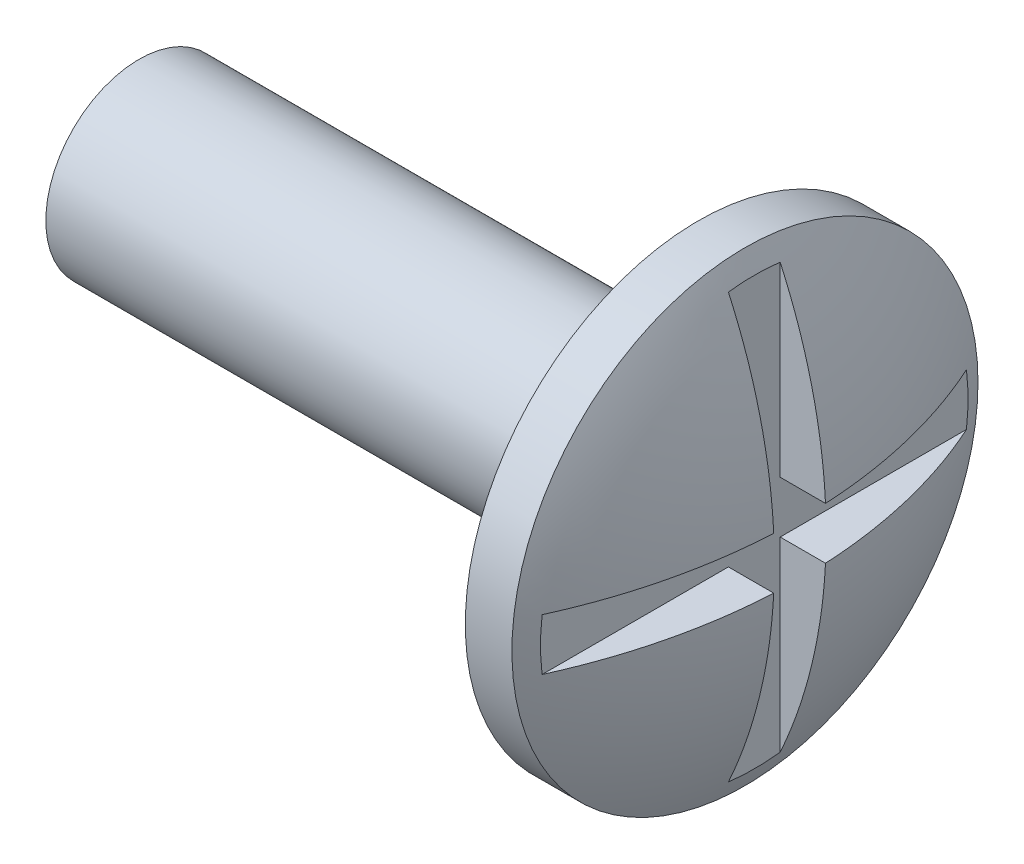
ISO-10303-21;
HEADER;
FILE_DESCRIPTION(('STEP AP214'),'2;1');
FILE_NAME('part.step','',(''),(''),'','','');
FILE_SCHEMA(('AUTOMOTIVE_DESIGN { 1 0 10303 214 1 1 1 1 }'));
ENDSEC;
DATA;
#1=APPLICATION_CONTEXT('core data for automotive mechanical design processes');
#2=APPLICATION_PROTOCOL_DEFINITION('international standard','automotive_design',2000,#1);
#3=PRODUCT_CONTEXT('',#1,'mechanical');
#4=PRODUCT('Part','Part','',(#3));
#5=PRODUCT_RELATED_PRODUCT_CATEGORY('part','',(#4));
#6=PRODUCT_DEFINITION_FORMATION('','',#4);
#7=PRODUCT_DEFINITION_CONTEXT('part definition',#1,'design');
#8=PRODUCT_DEFINITION('design','',#6,#7);
#9=PRODUCT_DEFINITION_SHAPE('','',#8);
#10=(LENGTH_UNIT() NAMED_UNIT(*) SI_UNIT(.MILLI.,.METRE.));
#11=(NAMED_UNIT(*) PLANE_ANGLE_UNIT() SI_UNIT($,.RADIAN.));
#12=(NAMED_UNIT(*) SI_UNIT($,.STERADIAN.) SOLID_ANGLE_UNIT());
#13=UNCERTAINTY_MEASURE_WITH_UNIT(LENGTH_MEASURE(1.E-05),#10,'distance_accuracy_value','');
#14=(GEOMETRIC_REPRESENTATION_CONTEXT(3) GLOBAL_UNCERTAINTY_ASSIGNED_CONTEXT((#13)) GLOBAL_UNIT_ASSIGNED_CONTEXT((#10,
#11,#12)) REPRESENTATION_CONTEXT('',''));
#15=CARTESIAN_POINT('',(0.,0.,0.));
#16=DIRECTION('',(0.,0.,1.));
#17=DIRECTION('',(1.,0.,0.));
#18=AXIS2_PLACEMENT_3D('',#15,#16,#17);
#19=CARTESIAN_POINT('',(-11.0166666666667,0.,0.));
#20=DIRECTION('',(1.,0.,0.));
#21=DIRECTION('',(0.,-1.,0.));
#22=AXIS2_PLACEMENT_3D('',#19,#20,#21);
#23=SPHERICAL_SURFACE('',#22,11.0166666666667);
#24=CARTESIAN_POINT('',(-11.0166666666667,0.555555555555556,0.));
#25=DIRECTION('',(0.,1.,0.));
#26=DIRECTION('',(0.,0.,1.));
#27=AXIS2_PLACEMENT_3D('',#24,#25,#26);
#28=CIRCLE('',#27,11.0026497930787);
#29=CARTESIAN_POINT('',(-0.0280516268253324,0.555555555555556,0.555555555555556));
#30=VERTEX_POINT('',#29);
#31=CARTESIAN_POINT('',(-1.,0.555555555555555,4.55243795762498));
#32=VERTEX_POINT('',#31);
#33=EDGE_CURVE('E11',#30,#32,#28,.F.);
#34=ORIENTED_EDGE('',*,*,#33,.F.);
#35=CARTESIAN_POINT('',(-11.0166666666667,0.,0.555555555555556));
#36=DIRECTION('',(0.,0.,1.));
#37=DIRECTION('',(0.,-1.,0.));
#38=AXIS2_PLACEMENT_3D('',#35,#36,#37);
#39=CIRCLE('',#38,11.0026497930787);
#40=CARTESIAN_POINT('',(-1.,4.55243795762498,0.555555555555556));
#41=VERTEX_POINT('',#40);
#42=EDGE_CURVE('E39',#41,#30,#39,.F.);
#43=ORIENTED_EDGE('',*,*,#42,.F.);
#44=CARTESIAN_POINT('',(-1.,0.,0.));
#45=DIRECTION('',(1.,0.,0.));
#46=DIRECTION('',(0.,0.,-1.));
#47=AXIS2_PLACEMENT_3D('',#44,#45,#46);
#48=CIRCLE('',#47,4.58621121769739);
#49=CARTESIAN_POINT('',(-1.,4.55243795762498,-0.555555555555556));
#50=VERTEX_POINT('',#49);
#51=EDGE_CURVE('E116',#41,#50,#48,.F.);
#52=ORIENTED_EDGE('',*,*,#51,.T.);
#53=CARTESIAN_POINT('',(-11.0166666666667,0.,-0.555555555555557));
#54=DIRECTION('',(0.,0.,-1.));
#55=DIRECTION('',(0.,1.,0.));
#56=AXIS2_PLACEMENT_3D('',#53,#54,#55);
#57=CIRCLE('',#56,11.0026497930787);
#58=CARTESIAN_POINT('',(-0.0280516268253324,0.555555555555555,-0.555555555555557));
#59=VERTEX_POINT('',#58);
#60=EDGE_CURVE('E161',#59,#50,#57,.F.);
#61=ORIENTED_EDGE('',*,*,#60,.F.);
#62=CARTESIAN_POINT('',(-11.0166666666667,0.555555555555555,0.));
#63=DIRECTION('',(0.,1.,0.));
#64=DIRECTION('',(0.,0.,1.));
#65=AXIS2_PLACEMENT_3D('',#62,#63,#64);
#66=CIRCLE('',#65,11.0026497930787);
#67=CARTESIAN_POINT('',(-1.,0.555555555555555,-4.55243795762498));
#68=VERTEX_POINT('',#67);
#69=EDGE_CURVE('E153',#68,#59,#66,.F.);
#70=ORIENTED_EDGE('',*,*,#69,.F.);
#71=CARTESIAN_POINT('',(-1.,-0.555555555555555,-4.55243795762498));
#72=VERTEX_POINT('',#71);
#73=EDGE_CURVE('E150',#68,#72,#48,.F.);
#74=ORIENTED_EDGE('',*,*,#73,.T.);
#75=CARTESIAN_POINT('',(-11.0166666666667,-0.555555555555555,0.));
#76=DIRECTION('',(0.,-1.,0.));
#77=DIRECTION('',(0.,0.,-1.));
#78=AXIS2_PLACEMENT_3D('',#75,#76,#77);
#79=CIRCLE('',#78,11.0026497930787);
#80=CARTESIAN_POINT('',(-0.0280516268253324,-0.555555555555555,-0.555555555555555));
#81=VERTEX_POINT('',#80);
#82=EDGE_CURVE('E157',#81,#72,#79,.F.);
#83=ORIENTED_EDGE('',*,*,#82,.F.);
#84=CARTESIAN_POINT('',(-11.0166666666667,0.,-0.555555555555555));
#85=DIRECTION('',(0.,0.,-1.));
#86=DIRECTION('',(0.,1.,0.));
#87=AXIS2_PLACEMENT_3D('',#84,#85,#86);
#88=CIRCLE('',#87,11.0026497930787);
#89=CARTESIAN_POINT('',(-1.,-4.55243795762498,-0.555555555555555));
#90=VERTEX_POINT('',#89);
#91=EDGE_CURVE('E159',#90,#81,#88,.F.);
#92=ORIENTED_EDGE('',*,*,#91,.F.);
#93=CARTESIAN_POINT('',(-1.,-4.55243795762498,0.555555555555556));
#94=VERTEX_POINT('',#93);
#95=EDGE_CURVE('E155',#90,#94,#48,.F.);
#96=ORIENTED_EDGE('',*,*,#95,.T.);
#97=CARTESIAN_POINT('',(-11.0166666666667,0.,0.555555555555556));
#98=DIRECTION('',(0.,0.,1.));
#99=DIRECTION('',(0.,-1.,0.));
#100=AXIS2_PLACEMENT_3D('',#97,#98,#99);
#101=CIRCLE('',#100,11.0026497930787);
#102=CARTESIAN_POINT('',(-0.0280516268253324,-0.555555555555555,0.555555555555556));
#103=VERTEX_POINT('',#102);
#104=EDGE_CURVE('E163',#103,#94,#101,.F.);
#105=ORIENTED_EDGE('',*,*,#104,.F.);
#106=CARTESIAN_POINT('',(-11.0166666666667,-0.555555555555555,0.));
#107=DIRECTION('',(0.,-1.,0.));
#108=DIRECTION('',(0.,0.,-1.));
#109=AXIS2_PLACEMENT_3D('',#106,#107,#108);
#110=CIRCLE('',#109,11.0026497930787);
#111=CARTESIAN_POINT('',(-1.,-0.555555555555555,4.55243795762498));
#112=VERTEX_POINT('',#111);
#113=EDGE_CURVE('E54',#112,#103,#110,.F.);
#114=ORIENTED_EDGE('',*,*,#113,.F.);
#115=EDGE_CURVE('E154',#112,#32,#48,.F.);
#116=ORIENTED_EDGE('',*,*,#115,.T.);
#117=EDGE_LOOP('',(#34,#43,#52,#61,#70,#74,#83,#92,#96,#105,#114,#116));
#118=FACE_BOUND('',#117,.T.);
#119=CARTESIAN_POINT('',(-1.2,0.,0.));
#120=DIRECTION('',(1.,0.,0.));
#121=DIRECTION('',(0.,0.,-1.));
#122=AXIS2_PLACEMENT_3D('',#119,#120,#121);
#123=CIRCLE('',#122,5.);
#124=CARTESIAN_POINT('',(-1.2,0.,-5.));
#125=VERTEX_POINT('',#124);
#126=EDGE_CURVE('E135',#125,#125,#123,.T.);
#127=ORIENTED_EDGE('',*,*,#126,.T.);
#128=EDGE_LOOP('',(#127));
#129=FACE_BOUND('',#128,.T.);
#130=ADVANCED_FACE('F32',(#118,#129),#23,.T.);
#131=CARTESIAN_POINT('',(-14.2,0.,0.));
#132=DIRECTION('',(-1.,0.,0.));
#133=DIRECTION('',(0.,0.,1.));
#134=AXIS2_PLACEMENT_3D('',#131,#132,#133);
#135=PLANE('',#134);
#136=CARTESIAN_POINT('',(-14.2,0.,0.));
#137=DIRECTION('',(1.,0.,0.));
#138=DIRECTION('',(0.,0.,-1.));
#139=AXIS2_PLACEMENT_3D('',#136,#137,#138);
#140=CIRCLE('',#139,2.);
#141=CARTESIAN_POINT('',(-14.2,0.,-2.));
#142=VERTEX_POINT('',#141);
#143=EDGE_CURVE('E147',#142,#142,#140,.T.);
#144=ORIENTED_EDGE('',*,*,#143,.F.);
#145=EDGE_LOOP('',(#144));
#146=FACE_BOUND('',#145,.T.);
#147=ADVANCED_FACE('F195',(#146),#135,.T.);
#148=CARTESIAN_POINT('',(0.,0.,0.));
#149=DIRECTION('',(1.,0.,0.));
#150=DIRECTION('',(0.,0.,-1.));
#151=AXIS2_PLACEMENT_3D('',#148,#149,#150);
#152=CYLINDRICAL_SURFACE('',#151,2.);
#153=ORIENTED_EDGE('',*,*,#143,.T.);
#154=EDGE_LOOP('',(#153));
#155=FACE_BOUND('',#154,.T.);
#156=CARTESIAN_POINT('',(-2.2,0.,0.));
#157=DIRECTION('',(1.,0.,0.));
#158=DIRECTION('',(0.,0.,-1.));
#159=AXIS2_PLACEMENT_3D('',#156,#157,#158);
#160=CIRCLE('',#159,2.);
#161=CARTESIAN_POINT('',(-2.2,0.,-2.));
#162=VERTEX_POINT('',#161);
#163=EDGE_CURVE('E144',#162,#162,#160,.T.);
#164=ORIENTED_EDGE('',*,*,#163,.F.);
#165=EDGE_LOOP('',(#164));
#166=FACE_BOUND('',#165,.T.);
#167=ADVANCED_FACE('F199',(#155,#166),#152,.T.);
#168=CARTESIAN_POINT('',(-2.2,2.,0.));
#169=DIRECTION('',(-1.,0.,0.));
#170=DIRECTION('',(0.,0.,1.));
#171=AXIS2_PLACEMENT_3D('',#168,#169,#170);
#172=PLANE('',#171);
#173=ORIENTED_EDGE('',*,*,#163,.T.);
#174=EDGE_LOOP('',(#173));
#175=FACE_BOUND('',#174,.T.);
#176=CARTESIAN_POINT('',(-2.2,0.,0.));
#177=DIRECTION('',(1.,0.,0.));
#178=DIRECTION('',(0.,0.,-1.));
#179=AXIS2_PLACEMENT_3D('',#176,#177,#178);
#180=CIRCLE('',#179,5.);
#181=CARTESIAN_POINT('',(-2.2,0.,-5.));
#182=VERTEX_POINT('',#181);
#183=EDGE_CURVE('E141',#182,#182,#180,.T.);
#184=ORIENTED_EDGE('',*,*,#183,.F.);
#185=EDGE_LOOP('',(#184));
#186=FACE_BOUND('',#185,.T.);
#187=ADVANCED_FACE('F204',(#175,#186),#172,.T.);
#188=CARTESIAN_POINT('',(0.,0.,0.));
#189=DIRECTION('',(1.,0.,0.));
#190=DIRECTION('',(0.,0.,-1.));
#191=AXIS2_PLACEMENT_3D('',#188,#189,#190);
#192=CYLINDRICAL_SURFACE('',#191,5.);
#193=ORIENTED_EDGE('',*,*,#183,.T.);
#194=EDGE_LOOP('',(#193));
#195=FACE_BOUND('',#194,.T.);
#196=ORIENTED_EDGE('',*,*,#126,.F.);
#197=EDGE_LOOP('',(#196));
#198=FACE_BOUND('',#197,.T.);
#199=ADVANCED_FACE('F211',(#195,#198),#192,.T.);
#200=CARTESIAN_POINT('',(0.,0.555555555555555,5.));
#201=DIRECTION('',(0.,1.,0.));
#202=DIRECTION('',(0.,0.,1.));
#203=AXIS2_PLACEMENT_3D('',#200,#201,#202);
#204=PLANE('',#203);
#205=ORIENTED_EDGE('',*,*,#33,.T.);
#206=DIRECTION('',(0.,0.,-1.));
#207=VECTOR('',#206,1.);
#208=CARTESIAN_POINT('',(-1.,0.555555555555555,5.));
#209=LINE('',#208,#207);
#210=CARTESIAN_POINT('',(-1.,0.555555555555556,0.555555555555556));
#211=VERTEX_POINT('',#210);
#212=EDGE_CURVE('E109',#32,#211,#209,.T.);
#213=ORIENTED_EDGE('',*,*,#212,.T.);
#214=DIRECTION('',(-1.,0.,0.));
#215=VECTOR('',#214,1.);
#216=CARTESIAN_POINT('',(0.,0.555555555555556,0.555555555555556));
#217=LINE('',#216,#215);
#218=EDGE_CURVE('E97',#30,#211,#217,.T.);
#219=ORIENTED_EDGE('',*,*,#218,.F.);
#220=EDGE_LOOP('',(#205,#213,#219));
#221=FACE_BOUND('',#220,.T.);
#222=ADVANCED_FACE('F110',(#221),#204,.F.);
#223=CARTESIAN_POINT('',(0.,-0.555555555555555,0.555555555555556));
#224=DIRECTION('',(0.,-1.,0.));
#225=DIRECTION('',(0.,0.,-1.));
#226=AXIS2_PLACEMENT_3D('',#223,#224,#225);
#227=PLANE('',#226);
#228=ORIENTED_EDGE('',*,*,#113,.T.);
#229=DIRECTION('',(-1.,0.,0.));
#230=VECTOR('',#229,1.);
#231=CARTESIAN_POINT('',(0.,-0.555555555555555,0.555555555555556));
#232=LINE('',#231,#230);
#233=CARTESIAN_POINT('',(-1.,-0.555555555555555,0.555555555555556));
#234=VERTEX_POINT('',#233);
#235=EDGE_CURVE('E133',#103,#234,#232,.T.);
#236=ORIENTED_EDGE('',*,*,#235,.T.);
#237=DIRECTION('',(0.,0.,1.));
#238=VECTOR('',#237,1.);
#239=CARTESIAN_POINT('',(-1.,-0.555555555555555,0.555555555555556));
#240=LINE('',#239,#238);
#241=EDGE_CURVE('E106',#234,#112,#240,.T.);
#242=ORIENTED_EDGE('',*,*,#241,.T.);
#243=EDGE_LOOP('',(#228,#236,#242));
#244=FACE_BOUND('',#243,.T.);
#245=ADVANCED_FACE('F217',(#244),#227,.F.);
#246=CARTESIAN_POINT('',(0.,-5.,0.555555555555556));
#247=DIRECTION('',(0.,0.,1.));
#248=DIRECTION('',(0.,-1.,0.));
#249=AXIS2_PLACEMENT_3D('',#246,#247,#248);
#250=PLANE('',#249);
#251=ORIENTED_EDGE('',*,*,#104,.T.);
#252=DIRECTION('',(0.,1.,0.));
#253=VECTOR('',#252,1.);
#254=CARTESIAN_POINT('',(-1.,-5.,0.555555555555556));
#255=LINE('',#254,#253);
#256=EDGE_CURVE('E129',#94,#234,#255,.T.);
#257=ORIENTED_EDGE('',*,*,#256,.T.);
#258=ORIENTED_EDGE('',*,*,#235,.F.);
#259=EDGE_LOOP('',(#251,#257,#258));
#260=FACE_BOUND('',#259,.T.);
#261=ADVANCED_FACE('F221',(#260),#250,.F.);
#262=CARTESIAN_POINT('',(0.,-0.555555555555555,-0.555555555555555));
#263=DIRECTION('',(0.,0.,-1.));
#264=DIRECTION('',(0.,1.,0.));
#265=AXIS2_PLACEMENT_3D('',#262,#263,#264);
#266=PLANE('',#265);
#267=ORIENTED_EDGE('',*,*,#91,.T.);
#268=DIRECTION('',(-1.,0.,0.));
#269=VECTOR('',#268,1.);
#270=CARTESIAN_POINT('',(0.,-0.555555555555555,-0.555555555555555));
#271=LINE('',#270,#269);
#272=CARTESIAN_POINT('',(-1.,-0.555555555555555,-0.555555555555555));
#273=VERTEX_POINT('',#272);
#274=EDGE_CURVE('E136',#81,#273,#271,.T.);
#275=ORIENTED_EDGE('',*,*,#274,.T.);
#276=DIRECTION('',(0.,-1.,0.));
#277=VECTOR('',#276,1.);
#278=CARTESIAN_POINT('',(-1.,-0.555555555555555,-0.555555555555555));
#279=LINE('',#278,#277);
#280=EDGE_CURVE('E126',#273,#90,#279,.T.);
#281=ORIENTED_EDGE('',*,*,#280,.T.);
#282=EDGE_LOOP('',(#267,#275,#281));
#283=FACE_BOUND('',#282,.T.);
#284=ADVANCED_FACE('F175',(#283),#266,.F.);
#285=CARTESIAN_POINT('',(0.,-0.555555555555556,-5.));
#286=DIRECTION('',(0.,-1.,0.));
#287=DIRECTION('',(0.,0.,-1.));
#288=AXIS2_PLACEMENT_3D('',#285,#286,#287);
#289=PLANE('',#288);
#290=ORIENTED_EDGE('',*,*,#82,.T.);
#291=DIRECTION('',(0.,0.,1.));
#292=VECTOR('',#291,1.);
#293=CARTESIAN_POINT('',(-1.,-0.555555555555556,-5.));
#294=LINE('',#293,#292);
#295=EDGE_CURVE('E46',#72,#273,#294,.T.);
#296=ORIENTED_EDGE('',*,*,#295,.T.);
#297=ORIENTED_EDGE('',*,*,#274,.F.);
#298=EDGE_LOOP('',(#290,#296,#297));
#299=FACE_BOUND('',#298,.T.);
#300=ADVANCED_FACE('F178',(#299),#289,.F.);
#301=CARTESIAN_POINT('',(0.,0.555555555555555,-0.555555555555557));
#302=DIRECTION('',(0.,1.,0.));
#303=DIRECTION('',(0.,0.,1.));
#304=AXIS2_PLACEMENT_3D('',#301,#302,#303);
#305=PLANE('',#304);
#306=ORIENTED_EDGE('',*,*,#69,.T.);
#307=DIRECTION('',(-1.,0.,0.));
#308=VECTOR('',#307,1.);
#309=CARTESIAN_POINT('',(0.,0.555555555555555,-0.555555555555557));
#310=LINE('',#309,#308);
#311=CARTESIAN_POINT('',(-1.,0.555555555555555,-0.555555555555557));
#312=VERTEX_POINT('',#311);
#313=EDGE_CURVE('E105',#59,#312,#310,.T.);
#314=ORIENTED_EDGE('',*,*,#313,.T.);
#315=DIRECTION('',(0.,0.,-1.));
#316=VECTOR('',#315,1.);
#317=CARTESIAN_POINT('',(-1.,0.555555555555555,-0.555555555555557));
#318=LINE('',#317,#316);
#319=EDGE_CURVE('E120',#312,#68,#318,.T.);
#320=ORIENTED_EDGE('',*,*,#319,.T.);
#321=EDGE_LOOP('',(#306,#314,#320));
#322=FACE_BOUND('',#321,.T.);
#323=ADVANCED_FACE('F182',(#322),#305,.F.);
#324=CARTESIAN_POINT('',(0.,5.,-0.555555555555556));
#325=DIRECTION('',(0.,0.,-1.));
#326=DIRECTION('',(0.,1.,0.));
#327=AXIS2_PLACEMENT_3D('',#324,#325,#326);
#328=PLANE('',#327);
#329=ORIENTED_EDGE('',*,*,#60,.T.);
#330=DIRECTION('',(0.,-1.,0.));
#331=VECTOR('',#330,1.);
#332=CARTESIAN_POINT('',(-1.,5.,-0.555555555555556));
#333=LINE('',#332,#331);
#334=EDGE_CURVE('E117',#50,#312,#333,.T.);
#335=ORIENTED_EDGE('',*,*,#334,.T.);
#336=ORIENTED_EDGE('',*,*,#313,.F.);
#337=EDGE_LOOP('',(#329,#335,#336));
#338=FACE_BOUND('',#337,.T.);
#339=ADVANCED_FACE('F185',(#338),#328,.F.);
#340=CARTESIAN_POINT('',(0.,0.555555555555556,0.555555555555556));
#341=DIRECTION('',(0.,0.,1.));
#342=DIRECTION('',(0.,-1.,0.));
#343=AXIS2_PLACEMENT_3D('',#340,#341,#342);
#344=PLANE('',#343);
#345=ORIENTED_EDGE('',*,*,#42,.T.);
#346=ORIENTED_EDGE('',*,*,#218,.T.);
#347=DIRECTION('',(0.,1.,0.));
#348=VECTOR('',#347,1.);
#349=CARTESIAN_POINT('',(-1.,0.555555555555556,0.555555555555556));
#350=LINE('',#349,#348);
#351=EDGE_CURVE('E101',#211,#41,#350,.T.);
#352=ORIENTED_EDGE('',*,*,#351,.T.);
#353=EDGE_LOOP('',(#345,#346,#352));
#354=FACE_BOUND('',#353,.T.);
#355=ADVANCED_FACE('F99',(#354),#344,.F.);
#356=CARTESIAN_POINT('',(-1.,0.555555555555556,0.555555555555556));
#357=DIRECTION('',(1.,0.,0.));
#358=DIRECTION('',(0.,0.,-1.));
#359=AXIS2_PLACEMENT_3D('',#356,#357,#358);
#360=PLANE('',#359);
#361=ORIENTED_EDGE('',*,*,#280,.F.);
#362=ORIENTED_EDGE('',*,*,#295,.F.);
#363=ORIENTED_EDGE('',*,*,#73,.F.);
#364=ORIENTED_EDGE('',*,*,#319,.F.);
#365=ORIENTED_EDGE('',*,*,#334,.F.);
#366=ORIENTED_EDGE('',*,*,#51,.F.);
#367=ORIENTED_EDGE('',*,*,#351,.F.);
#368=ORIENTED_EDGE('',*,*,#212,.F.);
#369=ORIENTED_EDGE('',*,*,#115,.F.);
#370=ORIENTED_EDGE('',*,*,#241,.F.);
#371=ORIENTED_EDGE('',*,*,#256,.F.);
#372=ORIENTED_EDGE('',*,*,#95,.F.);
#373=EDGE_LOOP('',(#361,#362,#363,#364,#365,#366,#367,#368,#369,#370,#371,#372));
#374=FACE_BOUND('',#373,.T.);
#375=ADVANCED_FACE('F113',(#374),#360,.T.);
#376=CLOSED_SHELL('',(#130,#147,#167,#187,#199,#222,#245,#261,#284,#300,#323,#339,#355,#375));
#377=MANIFOLD_SOLID_BREP('B2',#376);
#378=ADVANCED_BREP_SHAPE_REPRESENTATION('',(#18,#377),#14);
#379=SHAPE_DEFINITION_REPRESENTATION(#9,#378);
ENDSEC;
END-ISO-10303-21;
